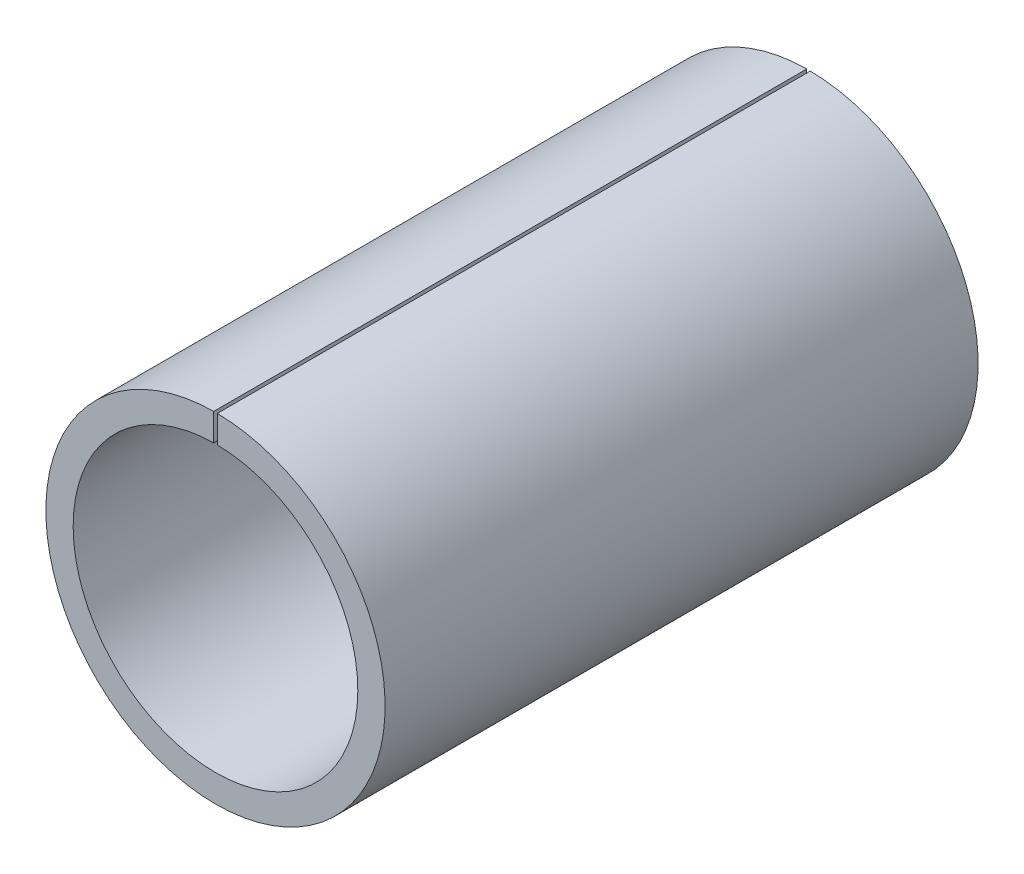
from build123d import *

# Parameters (mm, degrees)
ESQUISSE1_R      = 7.15
ESQUISSE1_R_2    = 6
EXTRUSION1_DEPTH = 25.5
EXTRUSION2_DEPTH = 200.530686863
EXTRUSION3_START = -0.5
EXTRUSION3_DEPTH = 0.5


with BuildPart() as part:
    # Esquisse1 → Extrusion1 (new body)
    with BuildSketch(Plane.XY):
        with Locations(Location((190, -10, 0), (0, 0, 90))):
            Circle(ESQUISSE1_R)
        with Locations(Location((190, -10, 0), (0, 0, 90))):
            Circle(ESQUISSE1_R_2, mode=Mode.SUBTRACT)
    extrude(amount=EXTRUSION1_DEPTH)

    # Esquisse2 → Extrusion2 (cut, through all)
    with BuildSketch(Plane.XY.offset(25.5)):
        with BuildLine():
            Line((189.925, -2.850393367), (189.925, -4.000468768))
            ThreePointArc((189.925, -4.000468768), (190, -4), (190.075, -4.000468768))
            Line((190.075, -4.000468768), (190.075, -2.850393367))
            ThreePointArc((190.075, -2.850393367), (190, -2.85), (189.925, -2.850393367))
        make_face()
    extrude(amount=-EXTRUSION2_DEPTH, mode=Mode.SUBTRACT)

    # Esquisse3 → Extrusion3 (cut)
    with BuildSketch(Plane.XY.offset(25.5).offset(EXTRUSION3_START)):
        with BuildLine():
            Line((189.925, -4.000468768), (189.925, -2.850393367))
            ThreePointArc((189.925, -2.850393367), (190, -17.15), (190.075, -2.850393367))
            Line((190.075, -2.850393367), (190.075, -4.000468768))
            ThreePointArc((190.075, -4.000468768), (190, -16), (189.925, -4.000468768))
        make_face()
    extrude(amount=EXTRUSION3_DEPTH, mode=Mode.SUBTRACT)


solid = part.part
